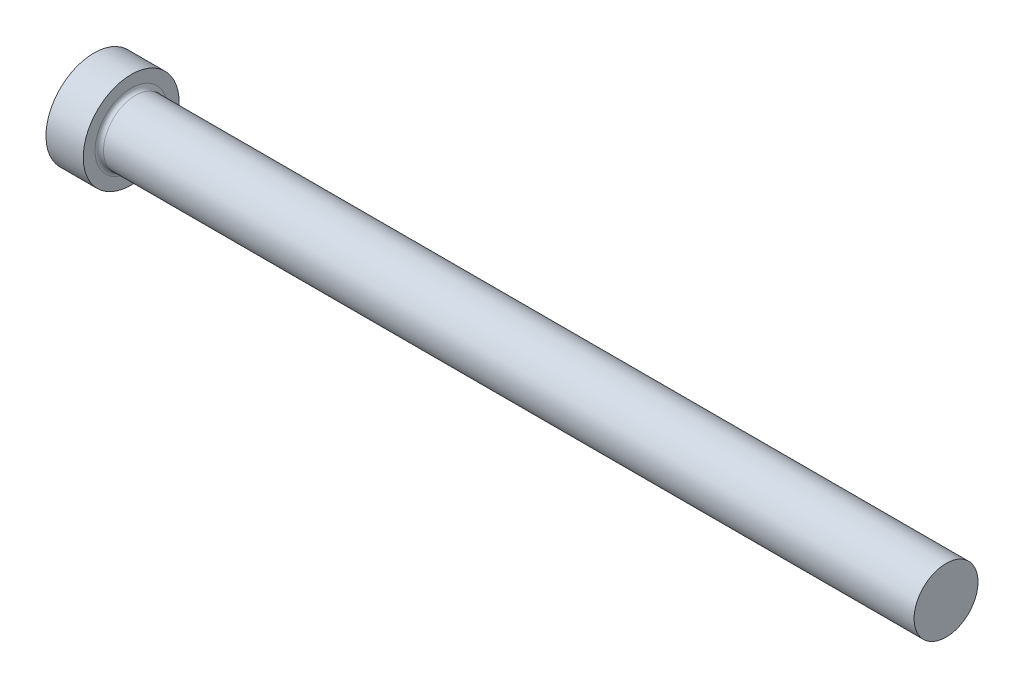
ISO-10303-21;
HEADER;
FILE_DESCRIPTION(('STEP AP214'),'2;1');
FILE_NAME('part.step','',(''),(''),'','','');
FILE_SCHEMA(('AUTOMOTIVE_DESIGN { 1 0 10303 214 1 1 1 1 }'));
ENDSEC;
DATA;
#1=APPLICATION_CONTEXT('core data for automotive mechanical design processes');
#2=APPLICATION_PROTOCOL_DEFINITION('international standard','automotive_design',2000,#1);
#3=PRODUCT_CONTEXT('',#1,'mechanical');
#4=PRODUCT('Part','Part','',(#3));
#5=PRODUCT_RELATED_PRODUCT_CATEGORY('part','',(#4));
#6=PRODUCT_DEFINITION_FORMATION('','',#4);
#7=PRODUCT_DEFINITION_CONTEXT('part definition',#1,'design');
#8=PRODUCT_DEFINITION('design','',#6,#7);
#9=PRODUCT_DEFINITION_SHAPE('','',#8);
#10=(LENGTH_UNIT() NAMED_UNIT(*) SI_UNIT(.MILLI.,.METRE.));
#11=(NAMED_UNIT(*) PLANE_ANGLE_UNIT() SI_UNIT($,.RADIAN.));
#12=(NAMED_UNIT(*) SI_UNIT($,.STERADIAN.) SOLID_ANGLE_UNIT());
#13=UNCERTAINTY_MEASURE_WITH_UNIT(LENGTH_MEASURE(1.E-05),#10,'distance_accuracy_value','');
#14=(GEOMETRIC_REPRESENTATION_CONTEXT(3) GLOBAL_UNCERTAINTY_ASSIGNED_CONTEXT((#13)) GLOBAL_UNIT_ASSIGNED_CONTEXT((#10,
#11,#12)) REPRESENTATION_CONTEXT('',''));
#15=CARTESIAN_POINT('',(0.,0.,0.));
#16=DIRECTION('',(0.,0.,1.));
#17=DIRECTION('',(1.,0.,0.));
#18=AXIS2_PLACEMENT_3D('',#15,#16,#17);
#19=CARTESIAN_POINT('',(0.,0.,0.));
#20=DIRECTION('',(-1.,0.,0.));
#21=DIRECTION('',(0.,-1.,0.));
#22=AXIS2_PLACEMENT_3D('',#19,#20,#21);
#23=PLANE('',#22);
#24=CARTESIAN_POINT('',(0.,0.,0.));
#25=DIRECTION('',(1.,0.,0.));
#26=DIRECTION('',(0.,1.,0.));
#27=AXIS2_PLACEMENT_3D('',#24,#25,#26);
#28=CIRCLE('',#27,9.);
#29=CARTESIAN_POINT('',(0.,9.,0.));
#30=VERTEX_POINT('',#29);
#31=EDGE_CURVE('E25',#30,#30,#28,.T.);
#32=ORIENTED_EDGE('',*,*,#31,.F.);
#33=EDGE_LOOP('',(#32));
#34=FACE_BOUND('',#33,.T.);
#35=ADVANCED_FACE('F14',(#34),#23,.T.);
#36=CARTESIAN_POINT('',(160.,0.,0.));
#37=DIRECTION('',(1.,0.,0.));
#38=DIRECTION('',(0.,1.,0.));
#39=AXIS2_PLACEMENT_3D('',#36,#37,#38);
#40=CYLINDRICAL_SURFACE('',#39,9.);
#41=ORIENTED_EDGE('',*,*,#31,.T.);
#42=EDGE_LOOP('',(#41));
#43=FACE_BOUND('',#42,.T.);
#44=CARTESIAN_POINT('',(7.,0.,0.));
#45=DIRECTION('',(1.,0.,0.));
#46=DIRECTION('',(0.,1.,0.));
#47=AXIS2_PLACEMENT_3D('',#44,#45,#46);
#48=CIRCLE('',#47,9.);
#49=CARTESIAN_POINT('',(7.,9.,0.));
#50=VERTEX_POINT('',#49);
#51=EDGE_CURVE('E29',#50,#50,#48,.T.);
#52=ORIENTED_EDGE('',*,*,#51,.F.);
#53=EDGE_LOOP('',(#52));
#54=FACE_BOUND('',#53,.T.);
#55=ADVANCED_FACE('F51',(#43,#54),#40,.T.);
#56=CARTESIAN_POINT('',(7.,9.,0.));
#57=DIRECTION('',(1.,0.,0.));
#58=DIRECTION('',(0.,1.,0.));
#59=AXIS2_PLACEMENT_3D('',#56,#57,#58);
#60=PLANE('',#59);
#61=CARTESIAN_POINT('',(7.,0.,0.));
#62=DIRECTION('',(1.,0.,0.));
#63=DIRECTION('',(0.,1.,0.));
#64=AXIS2_PLACEMENT_3D('',#61,#62,#63);
#65=CIRCLE('',#64,6.8);
#66=CARTESIAN_POINT('',(7.,6.8,0.));
#67=VERTEX_POINT('',#66);
#68=EDGE_CURVE('E9',#67,#67,#65,.F.);
#69=ORIENTED_EDGE('',*,*,#68,.T.);
#70=EDGE_LOOP('',(#69));
#71=FACE_BOUND('',#70,.T.);
#72=ORIENTED_EDGE('',*,*,#51,.T.);
#73=EDGE_LOOP('',(#72));
#74=FACE_BOUND('',#73,.T.);
#75=ADVANCED_FACE('F42',(#71,#74),#60,.T.);
#76=CARTESIAN_POINT('',(160.,0.,0.));
#77=DIRECTION('',(1.,0.,0.));
#78=DIRECTION('',(0.,1.,0.));
#79=AXIS2_PLACEMENT_3D('',#76,#77,#78);
#80=CYLINDRICAL_SURFACE('',#79,6.);
#81=CARTESIAN_POINT('',(7.8,0.,0.));
#82=DIRECTION('',(1.,0.,0.));
#83=DIRECTION('',(0.,1.,0.));
#84=AXIS2_PLACEMENT_3D('',#81,#82,#83);
#85=CIRCLE('',#84,6.);
#86=CARTESIAN_POINT('',(7.8,6.,0.));
#87=VERTEX_POINT('',#86);
#88=EDGE_CURVE('E21',#87,#87,#85,.T.);
#89=ORIENTED_EDGE('',*,*,#88,.T.);
#90=EDGE_LOOP('',(#89));
#91=FACE_BOUND('',#90,.T.);
#92=CARTESIAN_POINT('',(160.,0.,0.));
#93=DIRECTION('',(1.,0.,0.));
#94=DIRECTION('',(0.,1.,0.));
#95=AXIS2_PLACEMENT_3D('',#92,#93,#94);
#96=CIRCLE('',#95,6.);
#97=CARTESIAN_POINT('',(160.,6.,0.));
#98=VERTEX_POINT('',#97);
#99=EDGE_CURVE('E34',#98,#98,#96,.T.);
#100=ORIENTED_EDGE('',*,*,#99,.F.);
#101=EDGE_LOOP('',(#100));
#102=FACE_BOUND('',#101,.T.);
#103=ADVANCED_FACE('F40',(#91,#102),#80,.T.);
#104=CARTESIAN_POINT('',(160.,6.,0.));
#105=DIRECTION('',(1.,0.,0.));
#106=DIRECTION('',(0.,1.,0.));
#107=AXIS2_PLACEMENT_3D('',#104,#105,#106);
#108=PLANE('',#107);
#109=ORIENTED_EDGE('',*,*,#99,.T.);
#110=EDGE_LOOP('',(#109));
#111=FACE_BOUND('',#110,.T.);
#112=ADVANCED_FACE('F38',(#111),#108,.T.);
#113=CARTESIAN_POINT('',(7.8,0.,0.));
#114=DIRECTION('',(1.,0.,0.));
#115=DIRECTION('',(0.,1.,0.));
#116=AXIS2_PLACEMENT_3D('',#113,#114,#115);
#117=TOROIDAL_SURFACE('',#116,6.8,0.8);
#118=ORIENTED_EDGE('',*,*,#68,.F.);
#119=EDGE_LOOP('',(#118));
#120=FACE_BOUND('',#119,.T.);
#121=ORIENTED_EDGE('',*,*,#88,.F.);
#122=EDGE_LOOP('',(#121));
#123=FACE_BOUND('',#122,.T.);
#124=ADVANCED_FACE('F16',(#120,#123),#117,.F.);
#125=CLOSED_SHELL('',(#35,#55,#75,#103,#112,#124));
#126=MANIFOLD_SOLID_BREP('B1',#125);
#127=ADVANCED_BREP_SHAPE_REPRESENTATION('',(#18,#126),#14);
#128=SHAPE_DEFINITION_REPRESENTATION(#9,#127);
ENDSEC;
END-ISO-10303-21;
